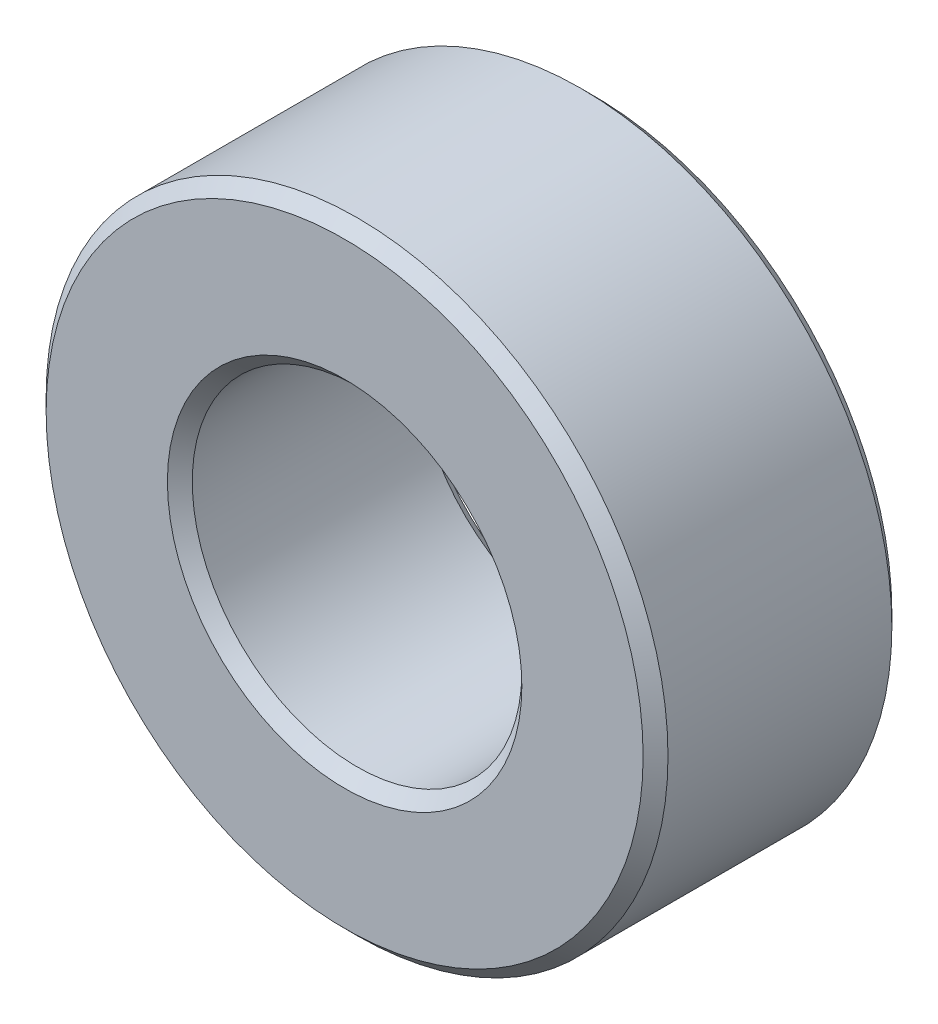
from build123d import *

# Parameters (mm, degrees)
SKETCH1_R           = 5
SKETCH1_R_2         = 2.65
BOSS_EXTRUDE2_DEPTH = 2
CHAMFER3_SIZE       = 0.2


with BuildPart() as part:
    # Sketch1 → Boss-Extrude2 (new, symmetric)
    with BuildSketch(Plane.XY):
        Circle(SKETCH1_R)
        Circle(SKETCH1_R_2, mode=Mode.SUBTRACT)
    extrude(amount=BOSS_EXTRUDE2_DEPTH, both=True)

    # Chamfer3
    chamfer3_edges = [part.edges().sort_by_distance(p)[0] for p in [
        (-5, 0, -2),
        (-5, 0, 2),
        (-2.65, 0, -2),
        (-2.65, 0, 2),
    ]]
    chamfer(chamfer3_edges, length=CHAMFER3_SIZE)


solid = part.part
